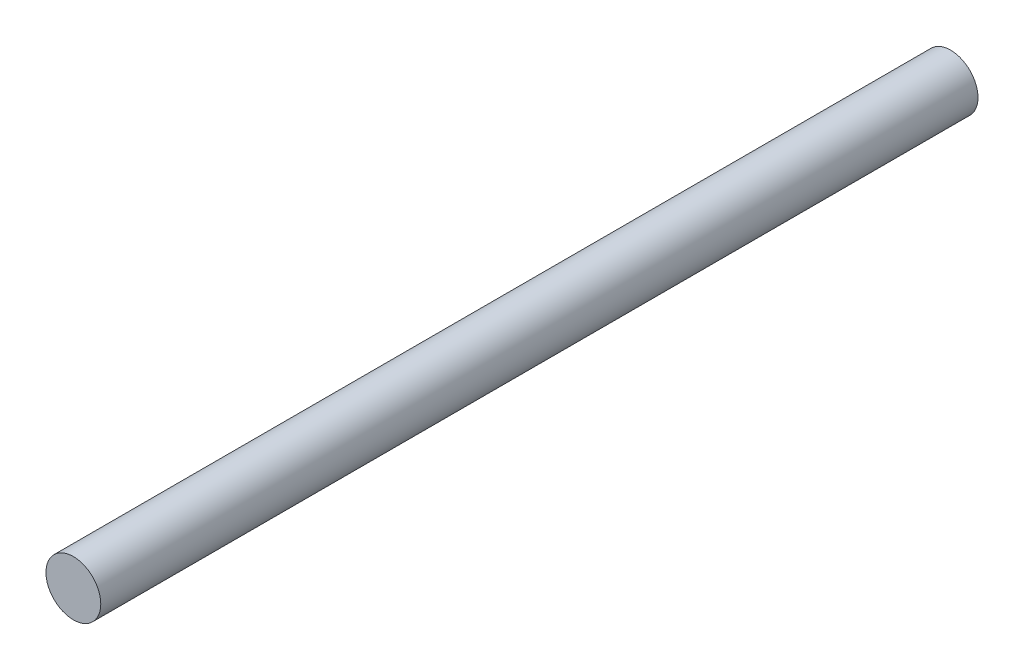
from build123d import *

# Parameters (mm, degrees)
ESQUISSE1_R        = 0.5
BOSS_EXTRU_1_DEPTH = 16


with BuildPart() as part:
    # Esquisse1 → Boss.-Extru.1 (new body)
    with BuildSketch(Plane.XY):
        Circle(ESQUISSE1_R)
    extrude(amount=BOSS_EXTRU_1_DEPTH)


solid = part.part
